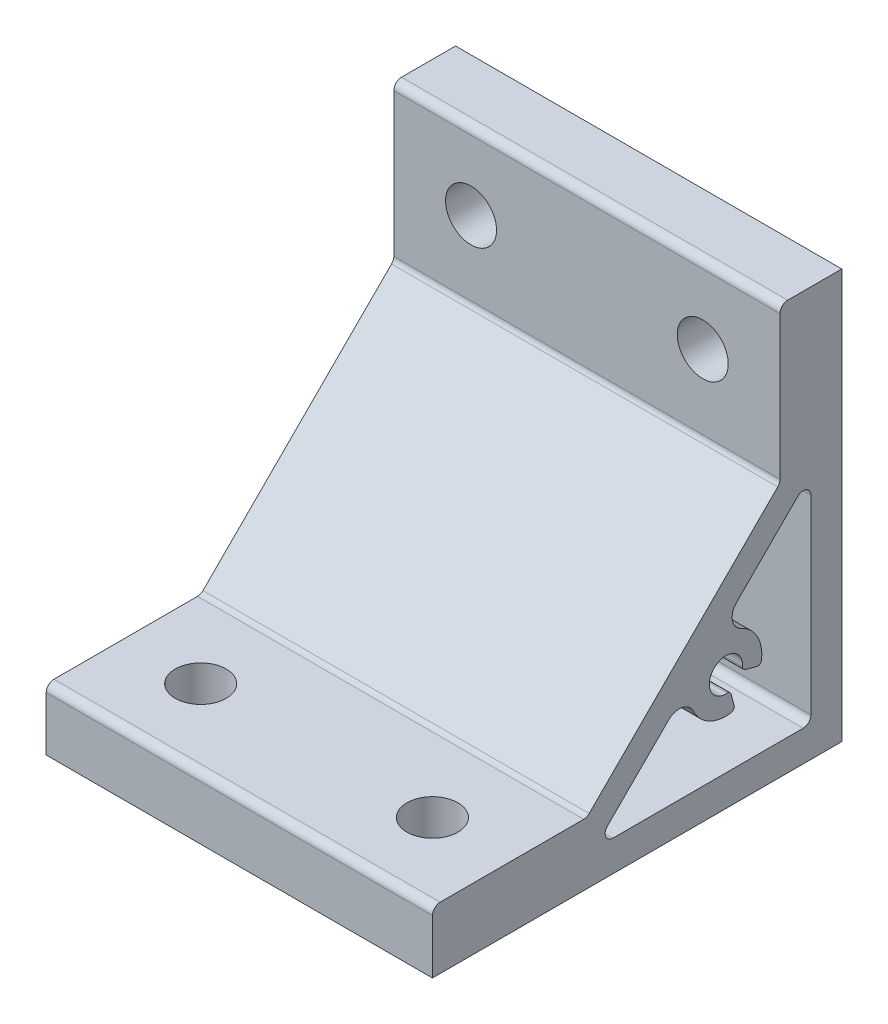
from build123d import *

# Parameters (mm, degrees)
EXTRUDE_1_DEPTH     = 25
SKETCH_2_R          = 3.3
CUT_EXTRUDE_1_DEPTH = 74.885045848
SKETCH_3_R          = 3.3
CUT_EXTRUDE_2_DEPTH = 74.885045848


with BuildPart() as part:
    # Sketch 1 → Extrude 1 (new, symmetric)
    with BuildSketch(Plane(origin=(0, 0, 0), x_dir=(0, 0, -1), z_dir=(1, 0, 0))):
        with BuildLine():
            Line((-53, 0), (0, 0))
            Line((0, 0), (0, 53))
            Line((0, 53), (-7, 53))
            ThreePointArc((-7, 53), (-7.707106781, 52.707106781), (-8, 52))
            Line((-8, 52), (-8, 33.414213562))
            ThreePointArc((-8, 33.414213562), (-8.076120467, 33.03153013), (-8.292893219, 32.707106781))
            Line((-8.292893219, 32.707106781), (-32.707106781, 8.292893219))
            ThreePointArc((-32.707106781, 8.292893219), (-33.03153013, 8.076120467), (-33.414213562, 8))
            Line((-33.414213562, 8), (-52, 8))
            ThreePointArc((-52, 8), (-52.707106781, 7.707106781), (-53, 7))
            Line((-53, 7), (-53, 0))
        make_face()
        with BuildLine():
            Line((-29.636038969, 4), (-5, 4))
            ThreePointArc((-5, 4), (-4.292893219, 4.292893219), (-4, 5))
            Line((-4, 5), (-4, 29.636038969))
            ThreePointArc((-4, 29.636038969), (-4.617316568, 30.559918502), (-5.707106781, 30.343145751))
            Line((-5.707106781, 30.343145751), (-13.607410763, 22.442841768))
            ThreePointArc((-13.607410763, 22.442841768), (-14.162708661, 20.680742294), (-13.037348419, 19.215506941))
            ThreePointArc((-13.037348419, 19.215506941), (-10.912614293, 17.217155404), (-10.396162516, 14.346409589))
            ThreePointArc((-10.396162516, 14.346409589), (-10.615521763, 13.999552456), (-11.020608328, 13.933725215))
            Line((-11.020608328, 13.933725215), (-12.486271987, 14.326448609))
            ThreePointArc((-12.486271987, 14.326448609), (-12.764234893, 14.519501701), (-12.85556766, 14.845371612))
            ThreePointArc((-12.85556766, 14.845371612), (-16.52027958, 16.52027958), (-14.845371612, 12.85556766))
            ThreePointArc((-14.845371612, 12.85556766), (-14.519501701, 12.764234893), (-14.326448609, 12.486271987))
            Line((-14.326448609, 12.486271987), (-13.933725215, 11.020608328))
            ThreePointArc((-13.933725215, 11.020608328), (-13.999552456, 10.615521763), (-14.346409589, 10.396162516))
            ThreePointArc((-14.346409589, 10.396162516), (-17.217155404, 10.912614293), (-19.215506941, 13.037348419))
            ThreePointArc((-19.215506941, 13.037348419), (-20.680742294, 14.162708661), (-22.442841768, 13.607410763))
            Line((-22.442841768, 13.607410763), (-30.343145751, 5.707106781))
            ThreePointArc((-30.343145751, 5.707106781), (-30.559918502, 4.617316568), (-29.636038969, 4))
        make_face(mode=Mode.SUBTRACT)
    extrude(amount=EXTRUDE_1_DEPTH, both=True)

    # Sketch 2 → Cut-Extrude 1 (cut, through all)
    with BuildSketch(Plane.XY.offset(8)):
        with Locations((15, 43)):
            Circle(SKETCH_2_R)
        with Locations((-15, 43)):
            Circle(SKETCH_2_R)
    extrude(amount=-CUT_EXTRUDE_1_DEPTH, mode=Mode.SUBTRACT)

    # Sketch 3 → Cut-Extrude 2 (cut, through all)
    with BuildSketch(Plane(origin=(0, 8, 0), x_dir=(-1, 0, 0), z_dir=(0, 1, 0))):
        with Locations(Location((-15, 43, 0), (0, 0, 90))):
            Circle(SKETCH_3_R)
        with Locations(Location((15, 43, 0), (0, 0, 90))):
            Circle(SKETCH_3_R)
    extrude(amount=-CUT_EXTRUDE_2_DEPTH, mode=Mode.SUBTRACT)


solid = part.part
